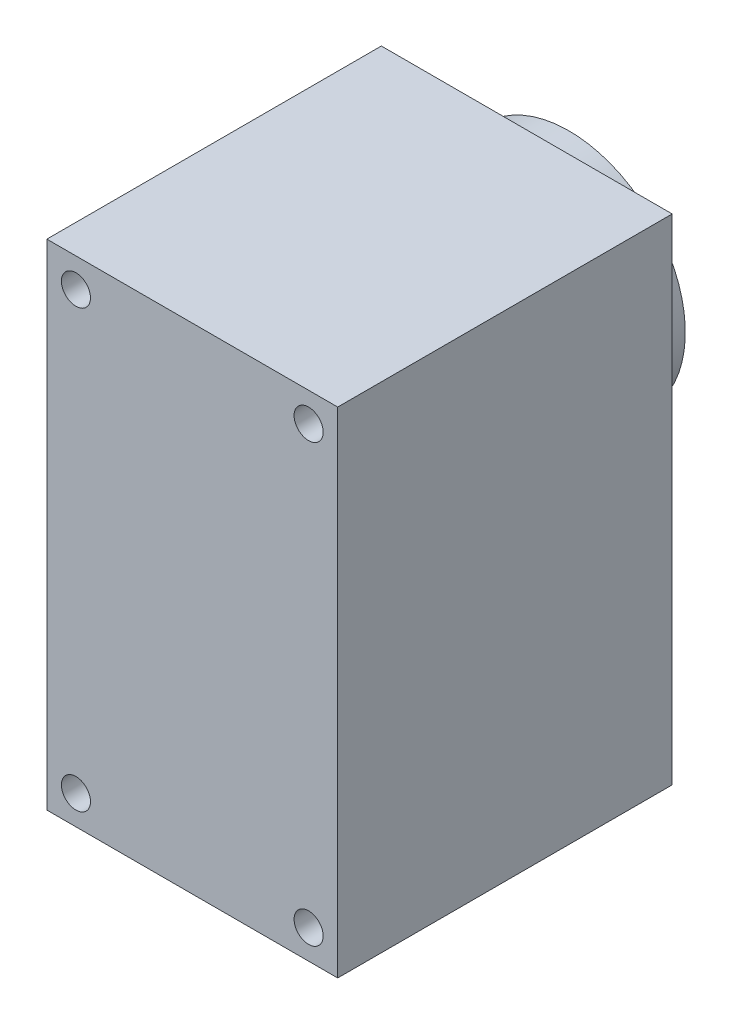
ISO-10303-21;
HEADER;
FILE_DESCRIPTION(('STEP AP214'),'2;1');
FILE_NAME('part.step','',(''),(''),'','','');
FILE_SCHEMA(('AUTOMOTIVE_DESIGN { 1 0 10303 214 1 1 1 1 }'));
ENDSEC;
DATA;
#1=APPLICATION_CONTEXT('core data for automotive mechanical design processes');
#2=APPLICATION_PROTOCOL_DEFINITION('international standard','automotive_design',2000,#1);
#3=PRODUCT_CONTEXT('',#1,'mechanical');
#4=PRODUCT('Part','Part','',(#3));
#5=PRODUCT_RELATED_PRODUCT_CATEGORY('part','',(#4));
#6=PRODUCT_DEFINITION_FORMATION('','',#4);
#7=PRODUCT_DEFINITION_CONTEXT('part definition',#1,'design');
#8=PRODUCT_DEFINITION('design','',#6,#7);
#9=PRODUCT_DEFINITION_SHAPE('','',#8);
#10=(LENGTH_UNIT() NAMED_UNIT(*) SI_UNIT(.MILLI.,.METRE.));
#11=(NAMED_UNIT(*) PLANE_ANGLE_UNIT() SI_UNIT($,.RADIAN.));
#12=(NAMED_UNIT(*) SI_UNIT($,.STERADIAN.) SOLID_ANGLE_UNIT());
#13=UNCERTAINTY_MEASURE_WITH_UNIT(LENGTH_MEASURE(1.E-05),#10,'distance_accuracy_value','');
#14=(GEOMETRIC_REPRESENTATION_CONTEXT(3) GLOBAL_UNCERTAINTY_ASSIGNED_CONTEXT((#13)) GLOBAL_UNIT_ASSIGNED_CONTEXT((#10,
#11,#12)) REPRESENTATION_CONTEXT('',''));
#15=CARTESIAN_POINT('',(0.,0.,0.));
#16=DIRECTION('',(0.,0.,1.));
#17=DIRECTION('',(1.,0.,0.));
#18=AXIS2_PLACEMENT_3D('',#15,#16,#17);
#19=CARTESIAN_POINT('',(0.,0.,23.));
#20=DIRECTION('',(0.,0.,1.));
#21=DIRECTION('',(1.,0.,0.));
#22=AXIS2_PLACEMENT_3D('',#19,#20,#21);
#23=PLANE('',#22);
#24=CARTESIAN_POINT('',(-1.59343062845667,-17.7317406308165,23.));
#25=DIRECTION('',(0.,0.,1.));
#26=DIRECTION('',(-1.,0.,0.));
#27=AXIS2_PLACEMENT_3D('',#24,#25,#26);
#28=CIRCLE('',#27,1.);
#29=CARTESIAN_POINT('',(-2.59343062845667,-17.7317406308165,23.));
#30=VERTEX_POINT('',#29);
#31=EDGE_CURVE('E151',#30,#30,#28,.T.);
#32=ORIENTED_EDGE('',*,*,#31,.F.);
#33=EDGE_LOOP('',(#32));
#34=FACE_BOUND('',#33,.T.);
#35=CARTESIAN_POINT('',(14.4065693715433,12.2682593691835,23.));
#36=DIRECTION('',(0.,0.,1.));
#37=DIRECTION('',(-1.,0.,0.));
#38=AXIS2_PLACEMENT_3D('',#35,#36,#37);
#39=CIRCLE('',#38,1.);
#40=CARTESIAN_POINT('',(13.4065693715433,12.2682593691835,23.));
#41=VERTEX_POINT('',#40);
#42=EDGE_CURVE('E121',#41,#41,#39,.T.);
#43=ORIENTED_EDGE('',*,*,#42,.F.);
#44=EDGE_LOOP('',(#43));
#45=FACE_BOUND('',#44,.T.);
#46=DIRECTION('',(-1.,0.,0.));
#47=VECTOR('',#46,1.);
#48=CARTESIAN_POINT('',(16.4065693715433,14.2682593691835,23.));
#49=LINE('',#48,#47);
#50=CARTESIAN_POINT('',(16.4065693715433,14.2682593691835,23.));
#51=VERTEX_POINT('',#50);
#52=CARTESIAN_POINT('',(-3.59343062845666,14.2682593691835,23.));
#53=VERTEX_POINT('',#52);
#54=EDGE_CURVE('E100',#51,#53,#49,.T.);
#55=ORIENTED_EDGE('',*,*,#54,.T.);
#56=DIRECTION('',(0.,-1.,0.));
#57=VECTOR('',#56,1.);
#58=CARTESIAN_POINT('',(-3.59343062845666,14.2682593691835,23.));
#59=LINE('',#58,#57);
#60=CARTESIAN_POINT('',(-3.59343062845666,-19.7317406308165,23.));
#61=VERTEX_POINT('',#60);
#62=EDGE_CURVE('E95',#53,#61,#59,.T.);
#63=ORIENTED_EDGE('',*,*,#62,.T.);
#64=DIRECTION('',(1.,0.,0.));
#65=VECTOR('',#64,1.);
#66=CARTESIAN_POINT('',(16.4065693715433,-19.7317406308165,23.));
#67=LINE('',#66,#65);
#68=CARTESIAN_POINT('',(16.4065693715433,-19.7317406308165,23.));
#69=VERTEX_POINT('',#68);
#70=EDGE_CURVE('E98',#61,#69,#67,.T.);
#71=ORIENTED_EDGE('',*,*,#70,.T.);
#72=DIRECTION('',(0.,1.,0.));
#73=VECTOR('',#72,1.);
#74=CARTESIAN_POINT('',(16.4065693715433,-19.7317406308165,23.));
#75=LINE('',#74,#73);
#76=EDGE_CURVE('E64',#69,#51,#75,.T.);
#77=ORIENTED_EDGE('',*,*,#76,.T.);
#78=EDGE_LOOP('',(#55,#63,#71,#77));
#79=FACE_BOUND('',#78,.T.);
#80=CARTESIAN_POINT('',(-1.59343062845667,12.2682593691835,23.));
#81=DIRECTION('',(0.,0.,1.));
#82=DIRECTION('',(1.,0.,0.));
#83=AXIS2_PLACEMENT_3D('',#80,#81,#82);
#84=CIRCLE('',#83,1.);
#85=CARTESIAN_POINT('',(-0.593430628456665,12.2682593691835,23.));
#86=VERTEX_POINT('',#85);
#87=EDGE_CURVE('E143',#86,#86,#84,.T.);
#88=ORIENTED_EDGE('',*,*,#87,.F.);
#89=EDGE_LOOP('',(#88));
#90=FACE_BOUND('',#89,.T.);
#91=CARTESIAN_POINT('',(14.4065693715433,-17.7317406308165,23.));
#92=DIRECTION('',(0.,0.,1.));
#93=DIRECTION('',(1.,0.,0.));
#94=AXIS2_PLACEMENT_3D('',#91,#92,#93);
#95=CIRCLE('',#94,1.);
#96=CARTESIAN_POINT('',(15.4065693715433,-17.7317406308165,23.));
#97=VERTEX_POINT('',#96);
#98=EDGE_CURVE('E159',#97,#97,#95,.T.);
#99=ORIENTED_EDGE('',*,*,#98,.F.);
#100=EDGE_LOOP('',(#99));
#101=FACE_BOUND('',#100,.T.);
#102=ADVANCED_FACE('F45',(#34,#45,#79,#90,#101),#23,.T.);
#103=CARTESIAN_POINT('',(0.,0.,0.));
#104=DIRECTION('',(0.,0.,1.));
#105=DIRECTION('',(1.,0.,0.));
#106=AXIS2_PLACEMENT_3D('',#103,#104,#105);
#107=PLANE('',#106);
#108=CARTESIAN_POINT('',(6.40656937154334,4.76825936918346,0.));
#109=DIRECTION('',(0.,0.,-1.));
#110=DIRECTION('',(-1.,0.,0.));
#111=AXIS2_PLACEMENT_3D('',#108,#109,#110);
#112=CIRCLE('',#111,8.);
#113=CARTESIAN_POINT('',(-1.59343062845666,4.76825936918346,0.));
#114=VERTEX_POINT('',#113);
#115=EDGE_CURVE('E11',#114,#114,#112,.T.);
#116=ORIENTED_EDGE('',*,*,#115,.F.);
#117=EDGE_LOOP('',(#116));
#118=FACE_BOUND('',#117,.T.);
#119=DIRECTION('',(-1.,0.,0.));
#120=VECTOR('',#119,1.);
#121=CARTESIAN_POINT('',(16.4065693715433,14.2682593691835,0.));
#122=LINE('',#121,#120);
#123=CARTESIAN_POINT('',(16.4065693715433,14.2682593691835,0.));
#124=VERTEX_POINT('',#123);
#125=CARTESIAN_POINT('',(-3.59343062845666,14.2682593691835,0.));
#126=VERTEX_POINT('',#125);
#127=EDGE_CURVE('E117',#124,#126,#122,.T.);
#128=ORIENTED_EDGE('',*,*,#127,.F.);
#129=DIRECTION('',(0.,1.,0.));
#130=VECTOR('',#129,1.);
#131=CARTESIAN_POINT('',(16.4065693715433,-19.7317406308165,0.));
#132=LINE('',#131,#130);
#133=CARTESIAN_POINT('',(16.4065693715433,-19.7317406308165,0.));
#134=VERTEX_POINT('',#133);
#135=EDGE_CURVE('E87',#134,#124,#132,.T.);
#136=ORIENTED_EDGE('',*,*,#135,.F.);
#137=DIRECTION('',(1.,0.,0.));
#138=VECTOR('',#137,1.);
#139=CARTESIAN_POINT('',(16.4065693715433,-19.7317406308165,0.));
#140=LINE('',#139,#138);
#141=CARTESIAN_POINT('',(-3.59343062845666,-19.7317406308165,0.));
#142=VERTEX_POINT('',#141);
#143=EDGE_CURVE('E81',#142,#134,#140,.T.);
#144=ORIENTED_EDGE('',*,*,#143,.F.);
#145=DIRECTION('',(0.,-1.,0.));
#146=VECTOR('',#145,1.);
#147=CARTESIAN_POINT('',(-3.59343062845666,14.2682593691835,0.));
#148=LINE('',#147,#146);
#149=EDGE_CURVE('E106',#126,#142,#148,.T.);
#150=ORIENTED_EDGE('',*,*,#149,.F.);
#151=EDGE_LOOP('',(#128,#136,#144,#150));
#152=FACE_BOUND('',#151,.T.);
#153=CARTESIAN_POINT('',(14.4065693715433,12.2682593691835,0.));
#154=DIRECTION('',(0.,0.,1.));
#155=DIRECTION('',(-1.,0.,0.));
#156=AXIS2_PLACEMENT_3D('',#153,#154,#155);
#157=CIRCLE('',#156,1.);
#158=CARTESIAN_POINT('',(13.4065693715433,12.2682593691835,0.));
#159=VERTEX_POINT('',#158);
#160=EDGE_CURVE('E139',#159,#159,#157,.T.);
#161=ORIENTED_EDGE('',*,*,#160,.T.);
#162=EDGE_LOOP('',(#161));
#163=FACE_BOUND('',#162,.T.);
#164=CARTESIAN_POINT('',(-1.59343062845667,12.2682593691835,0.));
#165=DIRECTION('',(0.,0.,1.));
#166=DIRECTION('',(1.,0.,0.));
#167=AXIS2_PLACEMENT_3D('',#164,#165,#166);
#168=CIRCLE('',#167,1.);
#169=CARTESIAN_POINT('',(-0.593430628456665,12.2682593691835,0.));
#170=VERTEX_POINT('',#169);
#171=EDGE_CURVE('E147',#170,#170,#168,.T.);
#172=ORIENTED_EDGE('',*,*,#171,.T.);
#173=EDGE_LOOP('',(#172));
#174=FACE_BOUND('',#173,.T.);
#175=CARTESIAN_POINT('',(-1.59343062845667,-17.7317406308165,0.));
#176=DIRECTION('',(0.,0.,1.));
#177=DIRECTION('',(-1.,0.,0.));
#178=AXIS2_PLACEMENT_3D('',#175,#176,#177);
#179=CIRCLE('',#178,1.);
#180=CARTESIAN_POINT('',(-2.59343062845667,-17.7317406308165,0.));
#181=VERTEX_POINT('',#180);
#182=EDGE_CURVE('E155',#181,#181,#179,.T.);
#183=ORIENTED_EDGE('',*,*,#182,.T.);
#184=EDGE_LOOP('',(#183));
#185=FACE_BOUND('',#184,.T.);
#186=CARTESIAN_POINT('',(14.4065693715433,-17.7317406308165,0.));
#187=DIRECTION('',(0.,0.,1.));
#188=DIRECTION('',(1.,0.,0.));
#189=AXIS2_PLACEMENT_3D('',#186,#187,#188);
#190=CIRCLE('',#189,1.);
#191=CARTESIAN_POINT('',(15.4065693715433,-17.7317406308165,0.));
#192=VERTEX_POINT('',#191);
#193=EDGE_CURVE('E163',#192,#192,#190,.T.);
#194=ORIENTED_EDGE('',*,*,#193,.T.);
#195=EDGE_LOOP('',(#194));
#196=FACE_BOUND('',#195,.T.);
#197=ADVANCED_FACE('F134',(#118,#152,#163,#174,#185,#196),#107,.F.);
#198=CARTESIAN_POINT('',(16.4065693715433,14.2682593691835,23.));
#199=DIRECTION('',(0.,-1.,0.));
#200=DIRECTION('',(1.,0.,0.));
#201=AXIS2_PLACEMENT_3D('',#198,#199,#200);
#202=PLANE('',#201);
#203=ORIENTED_EDGE('',*,*,#127,.T.);
#204=DIRECTION('',(0.,0.,-1.));
#205=VECTOR('',#204,1.);
#206=CARTESIAN_POINT('',(-3.59343062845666,14.2682593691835,23.));
#207=LINE('',#206,#205);
#208=EDGE_CURVE('E49',#53,#126,#207,.T.);
#209=ORIENTED_EDGE('',*,*,#208,.F.);
#210=ORIENTED_EDGE('',*,*,#54,.F.);
#211=DIRECTION('',(0.,0.,-1.));
#212=VECTOR('',#211,1.);
#213=CARTESIAN_POINT('',(16.4065693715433,14.2682593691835,23.));
#214=LINE('',#213,#212);
#215=EDGE_CURVE('E113',#51,#124,#214,.T.);
#216=ORIENTED_EDGE('',*,*,#215,.T.);
#217=EDGE_LOOP('',(#203,#209,#210,#216));
#218=FACE_BOUND('',#217,.T.);
#219=ADVANCED_FACE('F47',(#218),#202,.F.);
#220=CARTESIAN_POINT('',(-3.59343062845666,14.2682593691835,23.));
#221=DIRECTION('',(1.,0.,0.));
#222=DIRECTION('',(0.,1.,0.));
#223=AXIS2_PLACEMENT_3D('',#220,#221,#222);
#224=PLANE('',#223);
#225=ORIENTED_EDGE('',*,*,#149,.T.);
#226=DIRECTION('',(0.,0.,-1.));
#227=VECTOR('',#226,1.);
#228=CARTESIAN_POINT('',(-3.59343062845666,-19.7317406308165,23.));
#229=LINE('',#228,#227);
#230=EDGE_CURVE('E104',#61,#142,#229,.T.);
#231=ORIENTED_EDGE('',*,*,#230,.F.);
#232=ORIENTED_EDGE('',*,*,#62,.F.);
#233=ORIENTED_EDGE('',*,*,#208,.T.);
#234=EDGE_LOOP('',(#225,#231,#232,#233));
#235=FACE_BOUND('',#234,.T.);
#236=ADVANCED_FACE('F105',(#235),#224,.F.);
#237=CARTESIAN_POINT('',(16.4065693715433,-19.7317406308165,23.));
#238=DIRECTION('',(0.,1.,0.));
#239=DIRECTION('',(-1.,0.,0.));
#240=AXIS2_PLACEMENT_3D('',#237,#238,#239);
#241=PLANE('',#240);
#242=ORIENTED_EDGE('',*,*,#143,.T.);
#243=DIRECTION('',(0.,0.,-1.));
#244=VECTOR('',#243,1.);
#245=CARTESIAN_POINT('',(16.4065693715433,-19.7317406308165,23.));
#246=LINE('',#245,#244);
#247=EDGE_CURVE('E108',#69,#134,#246,.T.);
#248=ORIENTED_EDGE('',*,*,#247,.F.);
#249=ORIENTED_EDGE('',*,*,#70,.F.);
#250=ORIENTED_EDGE('',*,*,#230,.T.);
#251=EDGE_LOOP('',(#242,#248,#249,#250));
#252=FACE_BOUND('',#251,.T.);
#253=ADVANCED_FACE('F109',(#252),#241,.F.);
#254=CARTESIAN_POINT('',(16.4065693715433,-19.7317406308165,23.));
#255=DIRECTION('',(-1.,0.,0.));
#256=DIRECTION('',(0.,0.,1.));
#257=AXIS2_PLACEMENT_3D('',#254,#255,#256);
#258=PLANE('',#257);
#259=ORIENTED_EDGE('',*,*,#135,.T.);
#260=ORIENTED_EDGE('',*,*,#215,.F.);
#261=ORIENTED_EDGE('',*,*,#76,.F.);
#262=ORIENTED_EDGE('',*,*,#247,.T.);
#263=EDGE_LOOP('',(#259,#260,#261,#262));
#264=FACE_BOUND('',#263,.T.);
#265=ADVANCED_FACE('F131',(#264),#258,.F.);
#266=CARTESIAN_POINT('',(14.4065693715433,12.2682593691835,23.));
#267=DIRECTION('',(0.,0.,-1.));
#268=DIRECTION('',(-1.,0.,0.));
#269=AXIS2_PLACEMENT_3D('',#266,#267,#268);
#270=CYLINDRICAL_SURFACE('',#269,1.);
#271=ORIENTED_EDGE('',*,*,#42,.T.);
#272=EDGE_LOOP('',(#271));
#273=FACE_BOUND('',#272,.T.);
#274=ORIENTED_EDGE('',*,*,#160,.F.);
#275=EDGE_LOOP('',(#274));
#276=FACE_BOUND('',#275,.T.);
#277=ADVANCED_FACE('F251',(#273,#276),#270,.F.);
#278=CARTESIAN_POINT('',(-1.59343062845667,12.2682593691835,23.));
#279=DIRECTION('',(0.,0.,-1.));
#280=DIRECTION('',(-1.,0.,0.));
#281=AXIS2_PLACEMENT_3D('',#278,#279,#280);
#282=CYLINDRICAL_SURFACE('',#281,1.);
#283=ORIENTED_EDGE('',*,*,#87,.T.);
#284=EDGE_LOOP('',(#283));
#285=FACE_BOUND('',#284,.T.);
#286=ORIENTED_EDGE('',*,*,#171,.F.);
#287=EDGE_LOOP('',(#286));
#288=FACE_BOUND('',#287,.T.);
#289=ADVANCED_FACE('F292',(#285,#288),#282,.F.);
#290=CARTESIAN_POINT('',(-1.59343062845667,-17.7317406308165,23.));
#291=DIRECTION('',(0.,0.,-1.));
#292=DIRECTION('',(-1.,0.,0.));
#293=AXIS2_PLACEMENT_3D('',#290,#291,#292);
#294=CYLINDRICAL_SURFACE('',#293,1.);
#295=ORIENTED_EDGE('',*,*,#31,.T.);
#296=EDGE_LOOP('',(#295));
#297=FACE_BOUND('',#296,.T.);
#298=ORIENTED_EDGE('',*,*,#182,.F.);
#299=EDGE_LOOP('',(#298));
#300=FACE_BOUND('',#299,.T.);
#301=ADVANCED_FACE('F232',(#297,#300),#294,.F.);
#302=CARTESIAN_POINT('',(14.4065693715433,-17.7317406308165,23.));
#303=DIRECTION('',(0.,0.,-1.));
#304=DIRECTION('',(-1.,0.,0.));
#305=AXIS2_PLACEMENT_3D('',#302,#303,#304);
#306=CYLINDRICAL_SURFACE('',#305,1.);
#307=ORIENTED_EDGE('',*,*,#98,.T.);
#308=EDGE_LOOP('',(#307));
#309=FACE_BOUND('',#308,.T.);
#310=ORIENTED_EDGE('',*,*,#193,.F.);
#311=EDGE_LOOP('',(#310));
#312=FACE_BOUND('',#311,.T.);
#313=ADVANCED_FACE('F221',(#309,#312),#306,.F.);
#314=CARTESIAN_POINT('',(6.40656937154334,4.76825936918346,-2.9));
#315=DIRECTION('',(0.,0.,-1.));
#316=DIRECTION('',(-1.,0.,0.));
#317=AXIS2_PLACEMENT_3D('',#314,#315,#316);
#318=PLANE('',#317);
#319=CARTESIAN_POINT('',(0.406569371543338,4.76825936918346,-2.9));
#320=DIRECTION('',(0.,0.,-1.));
#321=DIRECTION('',(1.,0.,0.));
#322=AXIS2_PLACEMENT_3D('',#319,#320,#321);
#323=CIRCLE('',#322,1.);
#324=CARTESIAN_POINT('',(1.40656937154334,4.76825936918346,-2.9));
#325=VERTEX_POINT('',#324);
#326=EDGE_CURVE('E195',#325,#325,#323,.T.);
#327=ORIENTED_EDGE('',*,*,#326,.F.);
#328=EDGE_LOOP('',(#327));
#329=FACE_BOUND('',#328,.T.);
#330=CARTESIAN_POINT('',(12.4065693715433,4.76825936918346,-2.9));
#331=DIRECTION('',(0.,0.,-1.));
#332=DIRECTION('',(-1.,0.,0.));
#333=AXIS2_PLACEMENT_3D('',#330,#331,#332);
#334=CIRCLE('',#333,1.);
#335=CARTESIAN_POINT('',(11.4065693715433,4.76825936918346,-2.9));
#336=VERTEX_POINT('',#335);
#337=EDGE_CURVE('E179',#336,#336,#334,.T.);
#338=ORIENTED_EDGE('',*,*,#337,.F.);
#339=EDGE_LOOP('',(#338));
#340=FACE_BOUND('',#339,.T.);
#341=CARTESIAN_POINT('',(6.40656937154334,4.76825936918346,-2.9));
#342=DIRECTION('',(0.,0.,-1.));
#343=DIRECTION('',(-1.,0.,0.));
#344=AXIS2_PLACEMENT_3D('',#341,#342,#343);
#345=CIRCLE('',#344,8.);
#346=CARTESIAN_POINT('',(-1.59343062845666,4.76825936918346,-2.9));
#347=VERTEX_POINT('',#346);
#348=EDGE_CURVE('E167',#347,#347,#345,.T.);
#349=ORIENTED_EDGE('',*,*,#348,.T.);
#350=EDGE_LOOP('',(#349));
#351=FACE_BOUND('',#350,.T.);
#352=CARTESIAN_POINT('',(6.40656937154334,10.7682593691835,-2.9));
#353=DIRECTION('',(0.,0.,-1.));
#354=DIRECTION('',(-1.,0.,0.));
#355=AXIS2_PLACEMENT_3D('',#352,#353,#354);
#356=CIRCLE('',#355,1.);
#357=CARTESIAN_POINT('',(5.40656937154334,10.7682593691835,-2.9));
#358=VERTEX_POINT('',#357);
#359=EDGE_CURVE('E174',#358,#358,#356,.T.);
#360=ORIENTED_EDGE('',*,*,#359,.F.);
#361=EDGE_LOOP('',(#360));
#362=FACE_BOUND('',#361,.T.);
#363=CARTESIAN_POINT('',(6.40656937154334,-1.23174063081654,-2.9));
#364=DIRECTION('',(0.,0.,-1.));
#365=DIRECTION('',(1.,0.,0.));
#366=AXIS2_PLACEMENT_3D('',#363,#364,#365);
#367=CIRCLE('',#366,1.);
#368=CARTESIAN_POINT('',(7.40656937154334,-1.23174063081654,-2.9));
#369=VERTEX_POINT('',#368);
#370=EDGE_CURVE('E187',#369,#369,#367,.T.);
#371=ORIENTED_EDGE('',*,*,#370,.F.);
#372=EDGE_LOOP('',(#371));
#373=FACE_BOUND('',#372,.T.);
#374=CARTESIAN_POINT('',(6.40656937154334,4.76825936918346,-2.9));
#375=DIRECTION('',(0.,0.,-1.));
#376=DIRECTION('',(-1.,0.,0.));
#377=AXIS2_PLACEMENT_3D('',#374,#375,#376);
#378=CIRCLE('',#377,1.);
#379=CARTESIAN_POINT('',(5.40656937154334,4.76825936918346,-2.9));
#380=VERTEX_POINT('',#379);
#381=EDGE_CURVE('E203',#380,#380,#378,.T.);
#382=ORIENTED_EDGE('',*,*,#381,.F.);
#383=EDGE_LOOP('',(#382));
#384=FACE_BOUND('',#383,.T.);
#385=ADVANCED_FACE('F218',(#329,#340,#351,#362,#373,#384),#318,.T.);
#386=CARTESIAN_POINT('',(6.40656937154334,4.76825936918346,-2.9));
#387=DIRECTION('',(0.,0.,1.));
#388=DIRECTION('',(1.,0.,0.));
#389=AXIS2_PLACEMENT_3D('',#386,#387,#388);
#390=CYLINDRICAL_SURFACE('',#389,8.);
#391=ORIENTED_EDGE('',*,*,#348,.F.);
#392=EDGE_LOOP('',(#391));
#393=FACE_BOUND('',#392,.T.);
#394=ORIENTED_EDGE('',*,*,#115,.T.);
#395=EDGE_LOOP('',(#394));
#396=FACE_BOUND('',#395,.T.);
#397=ADVANCED_FACE('F220',(#393,#396),#390,.T.);
#398=CARTESIAN_POINT('',(6.40656937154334,10.7682593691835,-2.9));
#399=DIRECTION('',(0.,0.,1.));
#400=DIRECTION('',(1.,0.,0.));
#401=AXIS2_PLACEMENT_3D('',#398,#399,#400);
#402=CYLINDRICAL_SURFACE('',#401,1.);
#403=ORIENTED_EDGE('',*,*,#359,.T.);
#404=EDGE_LOOP('',(#403));
#405=FACE_BOUND('',#404,.T.);
#406=CARTESIAN_POINT('',(6.40656937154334,10.7682593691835,0.));
#407=DIRECTION('',(0.,0.,-1.));
#408=DIRECTION('',(-1.,0.,0.));
#409=AXIS2_PLACEMENT_3D('',#406,#407,#408);
#410=CIRCLE('',#409,1.);
#411=CARTESIAN_POINT('',(5.40656937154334,10.7682593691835,0.));
#412=VERTEX_POINT('',#411);
#413=EDGE_CURVE('E175',#412,#412,#410,.T.);
#414=ORIENTED_EDGE('',*,*,#413,.F.);
#415=EDGE_LOOP('',(#414));
#416=FACE_BOUND('',#415,.T.);
#417=ADVANCED_FACE('F228',(#405,#416),#402,.F.);
#418=CARTESIAN_POINT('',(12.4065693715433,4.76825936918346,-2.9));
#419=DIRECTION('',(0.,0.,1.));
#420=DIRECTION('',(1.,0.,0.));
#421=AXIS2_PLACEMENT_3D('',#418,#419,#420);
#422=CYLINDRICAL_SURFACE('',#421,1.);
#423=ORIENTED_EDGE('',*,*,#337,.T.);
#424=EDGE_LOOP('',(#423));
#425=FACE_BOUND('',#424,.T.);
#426=CARTESIAN_POINT('',(12.4065693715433,4.76825936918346,0.));
#427=DIRECTION('',(0.,0.,-1.));
#428=DIRECTION('',(-1.,0.,0.));
#429=AXIS2_PLACEMENT_3D('',#426,#427,#428);
#430=CIRCLE('',#429,1.);
#431=CARTESIAN_POINT('',(11.4065693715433,4.76825936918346,0.));
#432=VERTEX_POINT('',#431);
#433=EDGE_CURVE('E183',#432,#432,#430,.T.);
#434=ORIENTED_EDGE('',*,*,#433,.F.);
#435=EDGE_LOOP('',(#434));
#436=FACE_BOUND('',#435,.T.);
#437=ADVANCED_FACE('F372',(#425,#436),#422,.F.);
#438=CARTESIAN_POINT('',(6.40656937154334,-1.23174063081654,-2.9));
#439=DIRECTION('',(0.,0.,1.));
#440=DIRECTION('',(1.,0.,0.));
#441=AXIS2_PLACEMENT_3D('',#438,#439,#440);
#442=CYLINDRICAL_SURFACE('',#441,1.);
#443=ORIENTED_EDGE('',*,*,#370,.T.);
#444=EDGE_LOOP('',(#443));
#445=FACE_BOUND('',#444,.T.);
#446=CARTESIAN_POINT('',(6.40656937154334,-1.23174063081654,0.));
#447=DIRECTION('',(0.,0.,-1.));
#448=DIRECTION('',(1.,0.,0.));
#449=AXIS2_PLACEMENT_3D('',#446,#447,#448);
#450=CIRCLE('',#449,1.);
#451=CARTESIAN_POINT('',(7.40656937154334,-1.23174063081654,0.));
#452=VERTEX_POINT('',#451);
#453=EDGE_CURVE('E191',#452,#452,#450,.T.);
#454=ORIENTED_EDGE('',*,*,#453,.F.);
#455=EDGE_LOOP('',(#454));
#456=FACE_BOUND('',#455,.T.);
#457=ADVANCED_FACE('F381',(#445,#456),#442,.F.);
#458=CARTESIAN_POINT('',(0.406569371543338,4.76825936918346,-2.9));
#459=DIRECTION('',(0.,0.,1.));
#460=DIRECTION('',(1.,0.,0.));
#461=AXIS2_PLACEMENT_3D('',#458,#459,#460);
#462=CYLINDRICAL_SURFACE('',#461,1.);
#463=ORIENTED_EDGE('',*,*,#326,.T.);
#464=EDGE_LOOP('',(#463));
#465=FACE_BOUND('',#464,.T.);
#466=CARTESIAN_POINT('',(0.406569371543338,4.76825936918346,0.));
#467=DIRECTION('',(0.,0.,-1.));
#468=DIRECTION('',(1.,0.,0.));
#469=AXIS2_PLACEMENT_3D('',#466,#467,#468);
#470=CIRCLE('',#469,1.);
#471=CARTESIAN_POINT('',(1.40656937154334,4.76825936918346,0.));
#472=VERTEX_POINT('',#471);
#473=EDGE_CURVE('E199',#472,#472,#470,.T.);
#474=ORIENTED_EDGE('',*,*,#473,.F.);
#475=EDGE_LOOP('',(#474));
#476=FACE_BOUND('',#475,.T.);
#477=ADVANCED_FACE('F391',(#465,#476),#462,.F.);
#478=CARTESIAN_POINT('',(6.40656937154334,4.76825936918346,-2.9));
#479=DIRECTION('',(0.,0.,1.));
#480=DIRECTION('',(1.,0.,0.));
#481=AXIS2_PLACEMENT_3D('',#478,#479,#480);
#482=CYLINDRICAL_SURFACE('',#481,1.);
#483=ORIENTED_EDGE('',*,*,#381,.T.);
#484=EDGE_LOOP('',(#483));
#485=FACE_BOUND('',#484,.T.);
#486=CARTESIAN_POINT('',(6.40656937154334,4.76825936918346,0.));
#487=DIRECTION('',(0.,0.,-1.));
#488=DIRECTION('',(-1.,0.,0.));
#489=AXIS2_PLACEMENT_3D('',#486,#487,#488);
#490=CIRCLE('',#489,1.);
#491=CARTESIAN_POINT('',(5.40656937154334,4.76825936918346,0.));
#492=VERTEX_POINT('',#491);
#493=EDGE_CURVE('E207',#492,#492,#490,.T.);
#494=ORIENTED_EDGE('',*,*,#493,.F.);
#495=EDGE_LOOP('',(#494));
#496=FACE_BOUND('',#495,.T.);
#497=ADVANCED_FACE('F215',(#485,#496),#482,.F.);
#498=ORIENTED_EDGE('',*,*,#473,.T.);
#499=EDGE_LOOP('',(#498));
#500=FACE_BOUND('',#499,.T.);
#501=ADVANCED_FACE('F325',(#500),#107,.F.);
#502=ORIENTED_EDGE('',*,*,#453,.T.);
#503=EDGE_LOOP('',(#502));
#504=FACE_BOUND('',#503,.T.);
#505=ADVANCED_FACE('F332',(#504),#107,.F.);
#506=ORIENTED_EDGE('',*,*,#433,.T.);
#507=EDGE_LOOP('',(#506));
#508=FACE_BOUND('',#507,.T.);
#509=ADVANCED_FACE('F340',(#508),#107,.F.);
#510=ORIENTED_EDGE('',*,*,#413,.T.);
#511=EDGE_LOOP('',(#510));
#512=FACE_BOUND('',#511,.T.);
#513=ADVANCED_FACE('F246',(#512),#107,.F.);
#514=ORIENTED_EDGE('',*,*,#493,.T.);
#515=EDGE_LOOP('',(#514));
#516=FACE_BOUND('',#515,.T.);
#517=ADVANCED_FACE('F247',(#516),#107,.F.);
#518=CLOSED_SHELL('',(#102,#197,#219,#236,#253,#265,#277,#289,#301,#313,#385,#397,#417,#437,
#457,#477,#497,#501,#505,#509,#513,#517));
#519=MANIFOLD_SOLID_BREP('B2',#518);
#520=ADVANCED_BREP_SHAPE_REPRESENTATION('',(#18,#519),#14);
#521=SHAPE_DEFINITION_REPRESENTATION(#9,#520);
ENDSEC;
END-ISO-10303-21;
